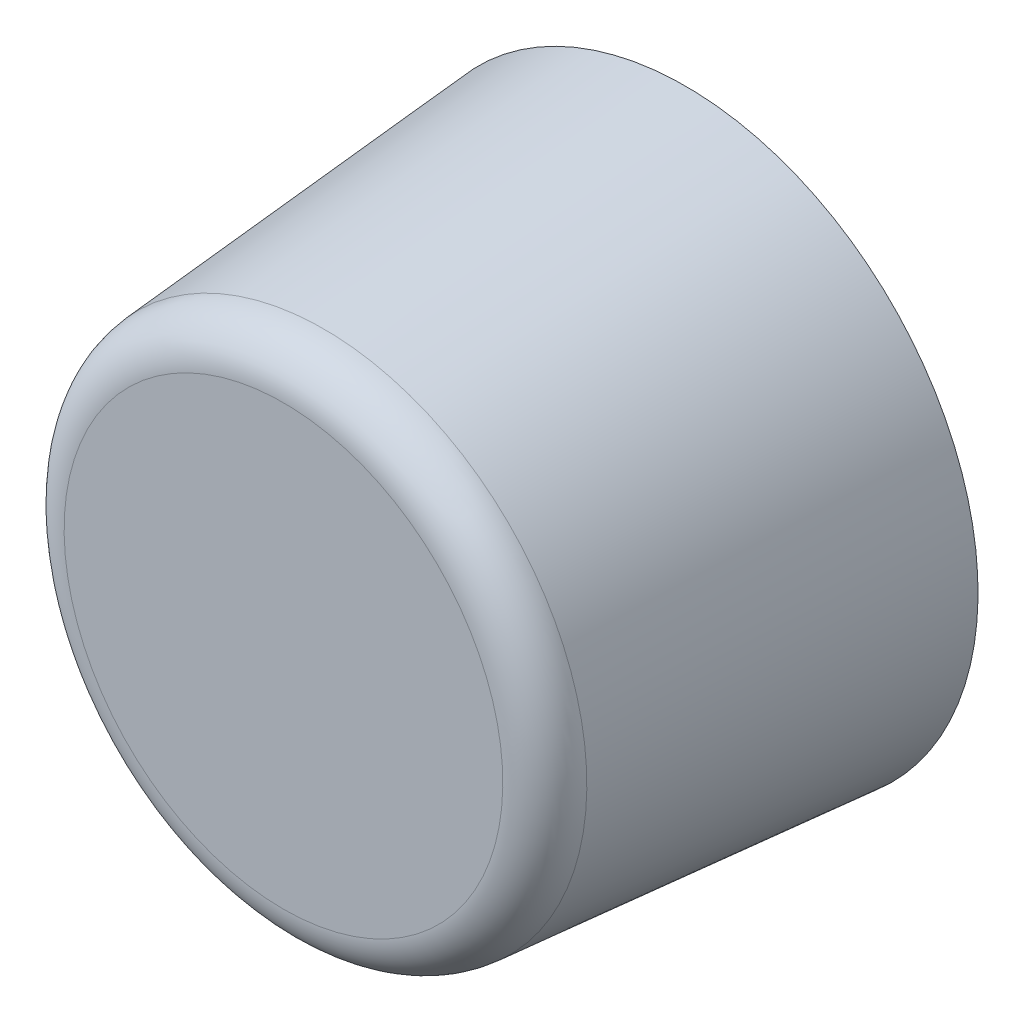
ISO-10303-21;
HEADER;
FILE_DESCRIPTION(('STEP AP214'),'2;1');
FILE_NAME('part.step','',(''),(''),'','','');
FILE_SCHEMA(('AUTOMOTIVE_DESIGN { 1 0 10303 214 1 1 1 1 }'));
ENDSEC;
DATA;
#1=APPLICATION_CONTEXT('core data for automotive mechanical design processes');
#2=APPLICATION_PROTOCOL_DEFINITION('international standard','automotive_design',2000,#1);
#3=PRODUCT_CONTEXT('',#1,'mechanical');
#4=PRODUCT('Part','Part','',(#3));
#5=PRODUCT_RELATED_PRODUCT_CATEGORY('part','',(#4));
#6=PRODUCT_DEFINITION_FORMATION('','',#4);
#7=PRODUCT_DEFINITION_CONTEXT('part definition',#1,'design');
#8=PRODUCT_DEFINITION('design','',#6,#7);
#9=PRODUCT_DEFINITION_SHAPE('','',#8);
#10=(LENGTH_UNIT() NAMED_UNIT(*) SI_UNIT(.MILLI.,.METRE.));
#11=(NAMED_UNIT(*) PLANE_ANGLE_UNIT() SI_UNIT($,.RADIAN.));
#12=(NAMED_UNIT(*) SI_UNIT($,.STERADIAN.) SOLID_ANGLE_UNIT());
#13=UNCERTAINTY_MEASURE_WITH_UNIT(LENGTH_MEASURE(1.E-05),#10,'distance_accuracy_value','');
#14=(GEOMETRIC_REPRESENTATION_CONTEXT(3) GLOBAL_UNCERTAINTY_ASSIGNED_CONTEXT((#13)) GLOBAL_UNIT_ASSIGNED_CONTEXT((#10,
#11,#12)) REPRESENTATION_CONTEXT('',''));
#15=CARTESIAN_POINT('',(0.,0.,0.));
#16=DIRECTION('',(0.,0.,1.));
#17=DIRECTION('',(1.,0.,0.));
#18=AXIS2_PLACEMENT_3D('',#15,#16,#17);
#19=CARTESIAN_POINT('',(0.,0.,22.));
#20=DIRECTION('',(0.,0.,1.));
#21=DIRECTION('',(0.,-1.,0.));
#22=AXIS2_PLACEMENT_3D('',#19,#20,#21);
#23=CYLINDRICAL_SURFACE('',#22,14.4);
#24=CARTESIAN_POINT('',(0.,0.,0.));
#25=DIRECTION('',(0.,0.,1.));
#26=DIRECTION('',(0.,-1.,0.));
#27=AXIS2_PLACEMENT_3D('',#24,#25,#26);
#28=CIRCLE('',#27,14.4);
#29=CARTESIAN_POINT('',(0.,-14.4,0.));
#30=VERTEX_POINT('',#29);
#31=EDGE_CURVE('E8',#30,#30,#28,.T.);
#32=ORIENTED_EDGE('',*,*,#31,.F.);
#33=EDGE_LOOP('',(#32));
#34=FACE_BOUND('',#33,.T.);
#35=CARTESIAN_POINT('',(0.,0.,0.049999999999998));
#36=DIRECTION('',(0.,0.,1.));
#37=DIRECTION('',(0.,-1.,0.));
#38=AXIS2_PLACEMENT_3D('',#35,#36,#37);
#39=CIRCLE('',#38,14.4);
#40=CARTESIAN_POINT('',(0.,-14.4,0.049999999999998));
#41=VERTEX_POINT('',#40);
#42=EDGE_CURVE('E34',#41,#41,#39,.T.);
#43=ORIENTED_EDGE('',*,*,#42,.T.);
#44=EDGE_LOOP('',(#43));
#45=FACE_BOUND('',#44,.T.);
#46=ADVANCED_FACE('F12',(#34,#45),#23,.F.);
#47=CARTESIAN_POINT('',(14.4,0.,0.));
#48=DIRECTION('',(0.,0.,1.));
#49=DIRECTION('',(0.,-1.,0.));
#50=AXIS2_PLACEMENT_3D('',#47,#48,#49);
#51=PLANE('',#50);
#52=CARTESIAN_POINT('',(0.,0.,0.));
#53=DIRECTION('',(0.,0.,1.));
#54=DIRECTION('',(0.,-1.,0.));
#55=AXIS2_PLACEMENT_3D('',#52,#53,#54);
#56=CIRCLE('',#55,16.);
#57=CARTESIAN_POINT('',(0.,-16.,0.));
#58=VERTEX_POINT('',#57);
#59=EDGE_CURVE('E18',#58,#58,#56,.T.);
#60=ORIENTED_EDGE('',*,*,#59,.F.);
#61=EDGE_LOOP('',(#60));
#62=FACE_BOUND('',#61,.T.);
#63=ORIENTED_EDGE('',*,*,#31,.T.);
#64=EDGE_LOOP('',(#63));
#65=FACE_BOUND('',#64,.T.);
#66=ADVANCED_FACE('F70',(#62,#65),#51,.F.);
#67=CARTESIAN_POINT('',(0.,0.,0.));
#68=DIRECTION('',(0.,0.,-1.));
#69=DIRECTION('',(0.,1.,0.));
#70=AXIS2_PLACEMENT_3D('',#67,#68,#69);
#71=CONICAL_SURFACE('',#70,16.,0.0810513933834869);
#72=CARTESIAN_POINT('',(0.,0.,19.7943104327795));
#73=DIRECTION('',(0.,0.,1.));
#74=DIRECTION('',(0.,-1.,0.));
#75=AXIS2_PLACEMENT_3D('',#72,#73,#74);
#76=CIRCLE('',#75,14.3921211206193);
#77=CARTESIAN_POINT('',(0.,-14.3921211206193,19.7943104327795));
#78=VERTEX_POINT('',#77);
#79=EDGE_CURVE('E22',#78,#78,#76,.T.);
#80=ORIENTED_EDGE('',*,*,#79,.F.);
#81=EDGE_LOOP('',(#80));
#82=FACE_BOUND('',#81,.T.);
#83=ORIENTED_EDGE('',*,*,#59,.T.);
#84=EDGE_LOOP('',(#83));
#85=FACE_BOUND('',#84,.T.);
#86=ADVANCED_FACE('F75',(#82,#85),#71,.T.);
#87=CARTESIAN_POINT('',(0.,0.,19.6));
#88=DIRECTION('',(0.,0.,1.));
#89=DIRECTION('',(0.,-1.,0.));
#90=AXIS2_PLACEMENT_3D('',#87,#88,#89);
#91=TOROIDAL_SURFACE('',#90,12.,2.4);
#92=ORIENTED_EDGE('',*,*,#79,.T.);
#93=EDGE_LOOP('',(#92));
#94=FACE_BOUND('',#93,.T.);
#95=CARTESIAN_POINT('',(0.,0.,22.));
#96=DIRECTION('',(0.,0.,1.));
#97=DIRECTION('',(0.,-1.,0.));
#98=AXIS2_PLACEMENT_3D('',#95,#96,#97);
#99=CIRCLE('',#98,12.);
#100=CARTESIAN_POINT('',(0.,-12.,22.));
#101=VERTEX_POINT('',#100);
#102=EDGE_CURVE('E26',#101,#101,#99,.T.);
#103=ORIENTED_EDGE('',*,*,#102,.F.);
#104=EDGE_LOOP('',(#103));
#105=FACE_BOUND('',#104,.T.);
#106=ADVANCED_FACE('F65',(#94,#105),#91,.T.);
#107=CARTESIAN_POINT('',(12.,0.,22.));
#108=DIRECTION('',(0.,0.,-1.));
#109=DIRECTION('',(0.,1.,0.));
#110=AXIS2_PLACEMENT_3D('',#107,#108,#109);
#111=PLANE('',#110);
#112=ORIENTED_EDGE('',*,*,#102,.T.);
#113=EDGE_LOOP('',(#112));
#114=FACE_BOUND('',#113,.T.);
#115=ADVANCED_FACE('F55',(#114),#111,.F.);
#116=CARTESIAN_POINT('',(0.,0.,0.));
#117=DIRECTION('',(0.,0.,1.));
#118=DIRECTION('',(0.,-1.,0.));
#119=AXIS2_PLACEMENT_3D('',#116,#117,#118);
#120=PLANE('',#119);
#121=CARTESIAN_POINT('',(0.,0.,0.));
#122=DIRECTION('',(0.,0.,1.));
#123=DIRECTION('',(0.,-1.,0.));
#124=AXIS2_PLACEMENT_3D('',#121,#122,#123);
#125=CIRCLE('',#124,14.35);
#126=CARTESIAN_POINT('',(0.,-14.35,0.));
#127=VERTEX_POINT('',#126);
#128=EDGE_CURVE('E31',#127,#127,#125,.T.);
#129=ORIENTED_EDGE('',*,*,#128,.F.);
#130=EDGE_LOOP('',(#129));
#131=FACE_BOUND('',#130,.T.);
#132=CARTESIAN_POINT('',(0.,0.,0.));
#133=DIRECTION('',(0.,0.,-1.));
#134=DIRECTION('',(0.,1.,0.));
#135=AXIS2_PLACEMENT_3D('',#132,#133,#134);
#136=CIRCLE('',#135,4.);
#137=CARTESIAN_POINT('',(0.,4.,0.));
#138=VERTEX_POINT('',#137);
#139=EDGE_CURVE('E38',#138,#138,#136,.T.);
#140=ORIENTED_EDGE('',*,*,#139,.F.);
#141=EDGE_LOOP('',(#140));
#142=FACE_BOUND('',#141,.T.);
#143=ADVANCED_FACE('F53',(#131,#142),#120,.F.);
#144=CARTESIAN_POINT('',(0.,0.,0.));
#145=DIRECTION('',(0.,0.,1.));
#146=DIRECTION('',(0.,-1.,0.));
#147=AXIS2_PLACEMENT_3D('',#144,#145,#146);
#148=CONICAL_SURFACE('',#147,14.35,0.785398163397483);
#149=ORIENTED_EDGE('',*,*,#42,.F.);
#150=EDGE_LOOP('',(#149));
#151=FACE_BOUND('',#150,.T.);
#152=ORIENTED_EDGE('',*,*,#128,.T.);
#153=EDGE_LOOP('',(#152));
#154=FACE_BOUND('',#153,.T.);
#155=ADVANCED_FACE('F49',(#151,#154),#148,.T.);
#156=CARTESIAN_POINT('',(0.,0.,8.));
#157=DIRECTION('',(0.,0.,-1.));
#158=DIRECTION('',(0.,1.,0.));
#159=AXIS2_PLACEMENT_3D('',#156,#157,#158);
#160=CYLINDRICAL_SURFACE('',#159,4.);
#161=CARTESIAN_POINT('',(0.,0.,8.));
#162=DIRECTION('',(0.,0.,-1.));
#163=DIRECTION('',(0.,1.,0.));
#164=AXIS2_PLACEMENT_3D('',#161,#162,#163);
#165=CIRCLE('',#164,4.);
#166=CARTESIAN_POINT('',(0.,4.,8.));
#167=VERTEX_POINT('',#166);
#168=EDGE_CURVE('E37',#167,#167,#165,.T.);
#169=ORIENTED_EDGE('',*,*,#168,.F.);
#170=EDGE_LOOP('',(#169));
#171=FACE_BOUND('',#170,.T.);
#172=ORIENTED_EDGE('',*,*,#139,.T.);
#173=EDGE_LOOP('',(#172));
#174=FACE_BOUND('',#173,.T.);
#175=ADVANCED_FACE('F46',(#171,#174),#160,.F.);
#176=CARTESIAN_POINT('',(0.,0.,8.));
#177=DIRECTION('',(0.,0.,-1.));
#178=DIRECTION('',(0.,1.,0.));
#179=AXIS2_PLACEMENT_3D('',#176,#177,#178);
#180=PLANE('',#179);
#181=ORIENTED_EDGE('',*,*,#168,.T.);
#182=EDGE_LOOP('',(#181));
#183=FACE_BOUND('',#182,.T.);
#184=ADVANCED_FACE('F44',(#183),#180,.T.);
#185=CLOSED_SHELL('',(#46,#66,#86,#106,#115,#143,#155,#175,#184));
#186=MANIFOLD_SOLID_BREP('B1',#185);
#187=ADVANCED_BREP_SHAPE_REPRESENTATION('',(#18,#186),#14);
#188=SHAPE_DEFINITION_REPRESENTATION(#9,#187);
ENDSEC;
END-ISO-10303-21;
